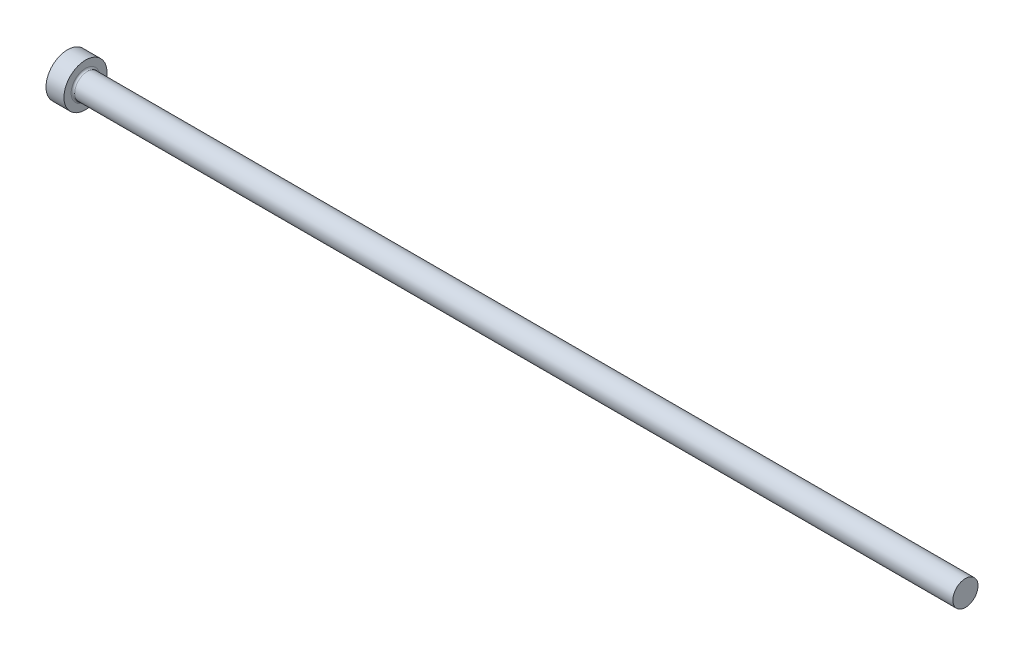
ISO-10303-21;
HEADER;
FILE_DESCRIPTION(('STEP AP214'),'2;1');
FILE_NAME('part.step','',(''),(''),'','','');
FILE_SCHEMA(('AUTOMOTIVE_DESIGN { 1 0 10303 214 1 1 1 1 }'));
ENDSEC;
DATA;
#1=APPLICATION_CONTEXT('core data for automotive mechanical design processes');
#2=APPLICATION_PROTOCOL_DEFINITION('international standard','automotive_design',2000,#1);
#3=PRODUCT_CONTEXT('',#1,'mechanical');
#4=PRODUCT('Part','Part','',(#3));
#5=PRODUCT_RELATED_PRODUCT_CATEGORY('part','',(#4));
#6=PRODUCT_DEFINITION_FORMATION('','',#4);
#7=PRODUCT_DEFINITION_CONTEXT('part definition',#1,'design');
#8=PRODUCT_DEFINITION('design','',#6,#7);
#9=PRODUCT_DEFINITION_SHAPE('','',#8);
#10=(LENGTH_UNIT() NAMED_UNIT(*) SI_UNIT(.MILLI.,.METRE.));
#11=(NAMED_UNIT(*) PLANE_ANGLE_UNIT() SI_UNIT($,.RADIAN.));
#12=(NAMED_UNIT(*) SI_UNIT($,.STERADIAN.) SOLID_ANGLE_UNIT());
#13=UNCERTAINTY_MEASURE_WITH_UNIT(LENGTH_MEASURE(1.E-05),#10,'distance_accuracy_value','');
#14=(GEOMETRIC_REPRESENTATION_CONTEXT(3) GLOBAL_UNCERTAINTY_ASSIGNED_CONTEXT((#13)) GLOBAL_UNIT_ASSIGNED_CONTEXT((#10,
#11,#12)) REPRESENTATION_CONTEXT('',''));
#15=CARTESIAN_POINT('',(0.,0.,0.));
#16=DIRECTION('',(0.,0.,1.));
#17=DIRECTION('',(1.,0.,0.));
#18=AXIS2_PLACEMENT_3D('',#15,#16,#17);
#19=CARTESIAN_POINT('',(0.,0.,0.));
#20=DIRECTION('',(-1.,0.,0.));
#21=DIRECTION('',(0.,-1.,0.));
#22=AXIS2_PLACEMENT_3D('',#19,#20,#21);
#23=PLANE('',#22);
#24=CARTESIAN_POINT('',(0.,0.,0.));
#25=DIRECTION('',(1.,0.,0.));
#26=DIRECTION('',(0.,1.,0.));
#27=AXIS2_PLACEMENT_3D('',#24,#25,#26);
#28=CIRCLE('',#27,6.);
#29=CARTESIAN_POINT('',(0.,6.,0.));
#30=VERTEX_POINT('',#29);
#31=EDGE_CURVE('E25',#30,#30,#28,.T.);
#32=ORIENTED_EDGE('',*,*,#31,.F.);
#33=EDGE_LOOP('',(#32));
#34=FACE_BOUND('',#33,.T.);
#35=ADVANCED_FACE('F14',(#34),#23,.T.);
#36=CARTESIAN_POINT('',(250.,0.,0.));
#37=DIRECTION('',(1.,0.,0.));
#38=DIRECTION('',(0.,1.,0.));
#39=AXIS2_PLACEMENT_3D('',#36,#37,#38);
#40=CYLINDRICAL_SURFACE('',#39,6.);
#41=ORIENTED_EDGE('',*,*,#31,.T.);
#42=EDGE_LOOP('',(#41));
#43=FACE_BOUND('',#42,.T.);
#44=CARTESIAN_POINT('',(5.,0.,0.));
#45=DIRECTION('',(1.,0.,0.));
#46=DIRECTION('',(0.,1.,0.));
#47=AXIS2_PLACEMENT_3D('',#44,#45,#46);
#48=CIRCLE('',#47,6.);
#49=CARTESIAN_POINT('',(5.,6.,0.));
#50=VERTEX_POINT('',#49);
#51=EDGE_CURVE('E29',#50,#50,#48,.T.);
#52=ORIENTED_EDGE('',*,*,#51,.F.);
#53=EDGE_LOOP('',(#52));
#54=FACE_BOUND('',#53,.T.);
#55=ADVANCED_FACE('F51',(#43,#54),#40,.T.);
#56=CARTESIAN_POINT('',(5.,6.,0.));
#57=DIRECTION('',(1.,0.,0.));
#58=DIRECTION('',(0.,1.,0.));
#59=AXIS2_PLACEMENT_3D('',#56,#57,#58);
#60=PLANE('',#59);
#61=CARTESIAN_POINT('',(5.,0.,0.));
#62=DIRECTION('',(1.,0.,0.));
#63=DIRECTION('',(0.,1.,0.));
#64=AXIS2_PLACEMENT_3D('',#61,#62,#63);
#65=CIRCLE('',#64,4.);
#66=CARTESIAN_POINT('',(5.,4.,0.));
#67=VERTEX_POINT('',#66);
#68=EDGE_CURVE('E9',#67,#67,#65,.F.);
#69=ORIENTED_EDGE('',*,*,#68,.T.);
#70=EDGE_LOOP('',(#69));
#71=FACE_BOUND('',#70,.T.);
#72=ORIENTED_EDGE('',*,*,#51,.T.);
#73=EDGE_LOOP('',(#72));
#74=FACE_BOUND('',#73,.T.);
#75=ADVANCED_FACE('F42',(#71,#74),#60,.T.);
#76=CARTESIAN_POINT('',(250.,0.,0.));
#77=DIRECTION('',(1.,0.,0.));
#78=DIRECTION('',(0.,1.,0.));
#79=AXIS2_PLACEMENT_3D('',#76,#77,#78);
#80=CYLINDRICAL_SURFACE('',#79,3.5);
#81=CARTESIAN_POINT('',(5.5,0.,0.));
#82=DIRECTION('',(1.,0.,0.));
#83=DIRECTION('',(0.,1.,0.));
#84=AXIS2_PLACEMENT_3D('',#81,#82,#83);
#85=CIRCLE('',#84,3.5);
#86=CARTESIAN_POINT('',(5.5,3.5,0.));
#87=VERTEX_POINT('',#86);
#88=EDGE_CURVE('E21',#87,#87,#85,.T.);
#89=ORIENTED_EDGE('',*,*,#88,.T.);
#90=EDGE_LOOP('',(#89));
#91=FACE_BOUND('',#90,.T.);
#92=CARTESIAN_POINT('',(250.,0.,0.));
#93=DIRECTION('',(1.,0.,0.));
#94=DIRECTION('',(0.,1.,0.));
#95=AXIS2_PLACEMENT_3D('',#92,#93,#94);
#96=CIRCLE('',#95,3.5);
#97=CARTESIAN_POINT('',(250.,3.50000000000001,0.));
#98=VERTEX_POINT('',#97);
#99=EDGE_CURVE('E34',#98,#98,#96,.T.);
#100=ORIENTED_EDGE('',*,*,#99,.F.);
#101=EDGE_LOOP('',(#100));
#102=FACE_BOUND('',#101,.T.);
#103=ADVANCED_FACE('F40',(#91,#102),#80,.T.);
#104=CARTESIAN_POINT('',(250.,3.5,0.));
#105=DIRECTION('',(1.,0.,0.));
#106=DIRECTION('',(0.,1.,0.));
#107=AXIS2_PLACEMENT_3D('',#104,#105,#106);
#108=PLANE('',#107);
#109=ORIENTED_EDGE('',*,*,#99,.T.);
#110=EDGE_LOOP('',(#109));
#111=FACE_BOUND('',#110,.T.);
#112=ADVANCED_FACE('F38',(#111),#108,.T.);
#113=CARTESIAN_POINT('',(5.5,0.,0.));
#114=DIRECTION('',(1.,0.,0.));
#115=DIRECTION('',(0.,1.,0.));
#116=AXIS2_PLACEMENT_3D('',#113,#114,#115);
#117=TOROIDAL_SURFACE('',#116,4.,0.5);
#118=ORIENTED_EDGE('',*,*,#68,.F.);
#119=EDGE_LOOP('',(#118));
#120=FACE_BOUND('',#119,.T.);
#121=ORIENTED_EDGE('',*,*,#88,.F.);
#122=EDGE_LOOP('',(#121));
#123=FACE_BOUND('',#122,.T.);
#124=ADVANCED_FACE('F16',(#120,#123),#117,.F.);
#125=CLOSED_SHELL('',(#35,#55,#75,#103,#112,#124));
#126=MANIFOLD_SOLID_BREP('B1',#125);
#127=ADVANCED_BREP_SHAPE_REPRESENTATION('',(#18,#126),#14);
#128=SHAPE_DEFINITION_REPRESENTATION(#9,#127);
ENDSEC;
END-ISO-10303-21;
